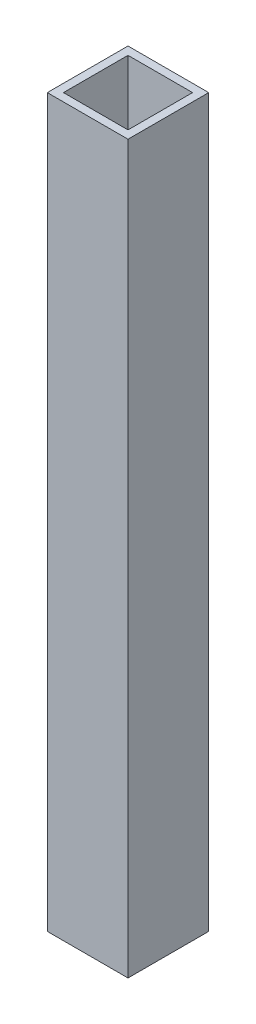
ISO-10303-21;
HEADER;
FILE_DESCRIPTION(('STEP AP214'),'2;1');
FILE_NAME('part.step','',(''),(''),'','','');
FILE_SCHEMA(('AUTOMOTIVE_DESIGN { 1 0 10303 214 1 1 1 1 }'));
ENDSEC;
DATA;
#1=APPLICATION_CONTEXT('core data for automotive mechanical design processes');
#2=APPLICATION_PROTOCOL_DEFINITION('international standard','automotive_design',2000,#1);
#3=PRODUCT_CONTEXT('',#1,'mechanical');
#4=PRODUCT('Part','Part','',(#3));
#5=PRODUCT_RELATED_PRODUCT_CATEGORY('part','',(#4));
#6=PRODUCT_DEFINITION_FORMATION('','',#4);
#7=PRODUCT_DEFINITION_CONTEXT('part definition',#1,'design');
#8=PRODUCT_DEFINITION('design','',#6,#7);
#9=PRODUCT_DEFINITION_SHAPE('','',#8);
#10=(LENGTH_UNIT() NAMED_UNIT(*) SI_UNIT(.MILLI.,.METRE.));
#11=(NAMED_UNIT(*) PLANE_ANGLE_UNIT() SI_UNIT($,.RADIAN.));
#12=(NAMED_UNIT(*) SI_UNIT($,.STERADIAN.) SOLID_ANGLE_UNIT());
#13=UNCERTAINTY_MEASURE_WITH_UNIT(LENGTH_MEASURE(1.E-05),#10,'distance_accuracy_value','');
#14=(GEOMETRIC_REPRESENTATION_CONTEXT(3) GLOBAL_UNCERTAINTY_ASSIGNED_CONTEXT((#13)) GLOBAL_UNIT_ASSIGNED_CONTEXT((#10,
#11,#12)) REPRESENTATION_CONTEXT('',''));
#15=CARTESIAN_POINT('',(0.,0.,0.));
#16=DIRECTION('',(0.,0.,1.));
#17=DIRECTION('',(1.,0.,0.));
#18=AXIS2_PLACEMENT_3D('',#15,#16,#17);
#19=CARTESIAN_POINT('',(0.,90.,0.));
#20=DIRECTION('',(0.,-1.,0.));
#21=DIRECTION('',(0.,0.,-1.));
#22=AXIS2_PLACEMENT_3D('',#19,#20,#21);
#23=PLANE('',#22);
#24=DIRECTION('',(0.,0.,1.));
#25=VECTOR('',#24,1.);
#26=CARTESIAN_POINT('',(0.,90.,0.));
#27=LINE('',#26,#25);
#28=CARTESIAN_POINT('',(0.,90.,-10.));
#29=VERTEX_POINT('',#28);
#30=CARTESIAN_POINT('',(0.,90.,0.));
#31=VERTEX_POINT('',#30);
#32=EDGE_CURVE('E134',#29,#31,#27,.T.);
#33=ORIENTED_EDGE('',*,*,#32,.T.);
#34=DIRECTION('',(1.,0.,0.));
#35=VECTOR('',#34,1.);
#36=CARTESIAN_POINT('',(0.,90.,0.));
#37=LINE('',#36,#35);
#38=CARTESIAN_POINT('',(10.,90.,0.));
#39=VERTEX_POINT('',#38);
#40=EDGE_CURVE('E137',#31,#39,#37,.T.);
#41=ORIENTED_EDGE('',*,*,#40,.T.);
#42=DIRECTION('',(0.,0.,-1.));
#43=VECTOR('',#42,1.);
#44=CARTESIAN_POINT('',(10.,90.,0.));
#45=LINE('',#44,#43);
#46=CARTESIAN_POINT('',(10.,90.,-10.));
#47=VERTEX_POINT('',#46);
#48=EDGE_CURVE('E140',#39,#47,#45,.T.);
#49=ORIENTED_EDGE('',*,*,#48,.T.);
#50=DIRECTION('',(-1.,0.,0.));
#51=VECTOR('',#50,1.);
#52=CARTESIAN_POINT('',(0.,90.,-10.));
#53=LINE('',#52,#51);
#54=EDGE_CURVE('E142',#47,#29,#53,.T.);
#55=ORIENTED_EDGE('',*,*,#54,.T.);
#56=EDGE_LOOP('',(#33,#41,#49,#55));
#57=FACE_BOUND('',#56,.T.);
#58=DIRECTION('',(0.,0.,1.));
#59=VECTOR('',#58,1.);
#60=CARTESIAN_POINT('',(1.,90.,-1.));
#61=LINE('',#60,#59);
#62=CARTESIAN_POINT('',(1.,90.,-9.));
#63=VERTEX_POINT('',#62);
#64=CARTESIAN_POINT('',(1.,90.,-1.));
#65=VERTEX_POINT('',#64);
#66=EDGE_CURVE('E98',#63,#65,#61,.T.);
#67=ORIENTED_EDGE('',*,*,#66,.F.);
#68=DIRECTION('',(-1.,0.,0.));
#69=VECTOR('',#68,1.);
#70=CARTESIAN_POINT('',(1.,90.,-9.));
#71=LINE('',#70,#69);
#72=CARTESIAN_POINT('',(9.,90.,-9.));
#73=VERTEX_POINT('',#72);
#74=EDGE_CURVE('E120',#73,#63,#71,.T.);
#75=ORIENTED_EDGE('',*,*,#74,.F.);
#76=DIRECTION('',(0.,0.,-1.));
#77=VECTOR('',#76,1.);
#78=CARTESIAN_POINT('',(9.,90.,-1.));
#79=LINE('',#78,#77);
#80=CARTESIAN_POINT('',(9.,90.,-1.));
#81=VERTEX_POINT('',#80);
#82=EDGE_CURVE('E118',#81,#73,#79,.T.);
#83=ORIENTED_EDGE('',*,*,#82,.F.);
#84=DIRECTION('',(1.,0.,0.));
#85=VECTOR('',#84,1.);
#86=CARTESIAN_POINT('',(1.,90.,-1.));
#87=LINE('',#86,#85);
#88=EDGE_CURVE('E106',#65,#81,#87,.T.);
#89=ORIENTED_EDGE('',*,*,#88,.F.);
#90=EDGE_LOOP('',(#67,#75,#83,#89));
#91=FACE_BOUND('',#90,.T.);
#92=ADVANCED_FACE('F33',(#57,#91),#23,.F.);
#93=CARTESIAN_POINT('',(0.,0.,0.));
#94=DIRECTION('',(0.,-1.,0.));
#95=DIRECTION('',(0.,0.,-1.));
#96=AXIS2_PLACEMENT_3D('',#93,#94,#95);
#97=PLANE('',#96);
#98=DIRECTION('',(0.,0.,1.));
#99=VECTOR('',#98,1.);
#100=CARTESIAN_POINT('',(0.,0.,0.));
#101=LINE('',#100,#99);
#102=CARTESIAN_POINT('',(0.,0.,-10.));
#103=VERTEX_POINT('',#102);
#104=CARTESIAN_POINT('',(0.,0.,0.));
#105=VERTEX_POINT('',#104);
#106=EDGE_CURVE('E114',#103,#105,#101,.T.);
#107=ORIENTED_EDGE('',*,*,#106,.F.);
#108=DIRECTION('',(-1.,0.,0.));
#109=VECTOR('',#108,1.);
#110=CARTESIAN_POINT('',(0.,0.,-10.));
#111=LINE('',#110,#109);
#112=CARTESIAN_POINT('',(10.,0.,-10.));
#113=VERTEX_POINT('',#112);
#114=EDGE_CURVE('E138',#113,#103,#111,.T.);
#115=ORIENTED_EDGE('',*,*,#114,.F.);
#116=DIRECTION('',(0.,0.,-1.));
#117=VECTOR('',#116,1.);
#118=CARTESIAN_POINT('',(10.,0.,0.));
#119=LINE('',#118,#117);
#120=CARTESIAN_POINT('',(10.,0.,0.));
#121=VERTEX_POINT('',#120);
#122=EDGE_CURVE('E149',#121,#113,#119,.T.);
#123=ORIENTED_EDGE('',*,*,#122,.F.);
#124=DIRECTION('',(1.,0.,0.));
#125=VECTOR('',#124,1.);
#126=CARTESIAN_POINT('',(0.,0.,0.));
#127=LINE('',#126,#125);
#128=EDGE_CURVE('E147',#105,#121,#127,.T.);
#129=ORIENTED_EDGE('',*,*,#128,.F.);
#130=EDGE_LOOP('',(#107,#115,#123,#129));
#131=FACE_BOUND('',#130,.T.);
#132=DIRECTION('',(-1.,0.,0.));
#133=VECTOR('',#132,1.);
#134=CARTESIAN_POINT('',(1.,0.,-9.));
#135=LINE('',#134,#133);
#136=CARTESIAN_POINT('',(9.,0.,-9.));
#137=VERTEX_POINT('',#136);
#138=CARTESIAN_POINT('',(1.,0.,-9.));
#139=VERTEX_POINT('',#138);
#140=EDGE_CURVE('E107',#137,#139,#135,.T.);
#141=ORIENTED_EDGE('',*,*,#140,.T.);
#142=DIRECTION('',(0.,0.,1.));
#143=VECTOR('',#142,1.);
#144=CARTESIAN_POINT('',(1.,0.,-1.));
#145=LINE('',#144,#143);
#146=CARTESIAN_POINT('',(1.,0.,-1.));
#147=VERTEX_POINT('',#146);
#148=EDGE_CURVE('E56',#139,#147,#145,.T.);
#149=ORIENTED_EDGE('',*,*,#148,.T.);
#150=DIRECTION('',(1.,0.,0.));
#151=VECTOR('',#150,1.);
#152=CARTESIAN_POINT('',(1.,0.,-1.));
#153=LINE('',#152,#151);
#154=CARTESIAN_POINT('',(9.,0.,-1.));
#155=VERTEX_POINT('',#154);
#156=EDGE_CURVE('E113',#147,#155,#153,.T.);
#157=ORIENTED_EDGE('',*,*,#156,.T.);
#158=DIRECTION('',(0.,0.,-1.));
#159=VECTOR('',#158,1.);
#160=CARTESIAN_POINT('',(9.,0.,-1.));
#161=LINE('',#160,#159);
#162=EDGE_CURVE('E126',#155,#137,#161,.T.);
#163=ORIENTED_EDGE('',*,*,#162,.T.);
#164=EDGE_LOOP('',(#141,#149,#157,#163));
#165=FACE_BOUND('',#164,.T.);
#166=ADVANCED_FACE('F167',(#131,#165),#97,.T.);
#167=CARTESIAN_POINT('',(0.,90.,0.));
#168=DIRECTION('',(1.,0.,0.));
#169=DIRECTION('',(0.,0.,-1.));
#170=AXIS2_PLACEMENT_3D('',#167,#168,#169);
#171=PLANE('',#170);
#172=ORIENTED_EDGE('',*,*,#106,.T.);
#173=DIRECTION('',(0.,-1.,0.));
#174=VECTOR('',#173,1.);
#175=CARTESIAN_POINT('',(0.,90.,0.));
#176=LINE('',#175,#174);
#177=EDGE_CURVE('E11',#31,#105,#176,.T.);
#178=ORIENTED_EDGE('',*,*,#177,.F.);
#179=ORIENTED_EDGE('',*,*,#32,.F.);
#180=DIRECTION('',(0.,-1.,0.));
#181=VECTOR('',#180,1.);
#182=CARTESIAN_POINT('',(0.,90.,-10.));
#183=LINE('',#182,#181);
#184=EDGE_CURVE('E144',#29,#103,#183,.T.);
#185=ORIENTED_EDGE('',*,*,#184,.T.);
#186=EDGE_LOOP('',(#172,#178,#179,#185));
#187=FACE_BOUND('',#186,.T.);
#188=ADVANCED_FACE('F35',(#187),#171,.F.);
#189=CARTESIAN_POINT('',(0.,90.,0.));
#190=DIRECTION('',(0.,0.,-1.));
#191=DIRECTION('',(-1.,0.,0.));
#192=AXIS2_PLACEMENT_3D('',#189,#190,#191);
#193=PLANE('',#192);
#194=ORIENTED_EDGE('',*,*,#128,.T.);
#195=DIRECTION('',(0.,-1.,0.));
#196=VECTOR('',#195,1.);
#197=CARTESIAN_POINT('',(10.,90.,0.));
#198=LINE('',#197,#196);
#199=EDGE_CURVE('E41',#39,#121,#198,.T.);
#200=ORIENTED_EDGE('',*,*,#199,.F.);
#201=ORIENTED_EDGE('',*,*,#40,.F.);
#202=ORIENTED_EDGE('',*,*,#177,.T.);
#203=EDGE_LOOP('',(#194,#200,#201,#202));
#204=FACE_BOUND('',#203,.T.);
#205=ADVANCED_FACE('F177',(#204),#193,.F.);
#206=CARTESIAN_POINT('',(10.,90.,0.));
#207=DIRECTION('',(-1.,0.,0.));
#208=DIRECTION('',(0.,0.,1.));
#209=AXIS2_PLACEMENT_3D('',#206,#207,#208);
#210=PLANE('',#209);
#211=ORIENTED_EDGE('',*,*,#122,.T.);
#212=DIRECTION('',(0.,-1.,0.));
#213=VECTOR('',#212,1.);
#214=CARTESIAN_POINT('',(10.,90.,-10.));
#215=LINE('',#214,#213);
#216=EDGE_CURVE('E154',#47,#113,#215,.T.);
#217=ORIENTED_EDGE('',*,*,#216,.F.);
#218=ORIENTED_EDGE('',*,*,#48,.F.);
#219=ORIENTED_EDGE('',*,*,#199,.T.);
#220=EDGE_LOOP('',(#211,#217,#218,#219));
#221=FACE_BOUND('',#220,.T.);
#222=ADVANCED_FACE('F161',(#221),#210,.F.);
#223=CARTESIAN_POINT('',(0.,90.,-10.));
#224=DIRECTION('',(0.,0.,1.));
#225=DIRECTION('',(1.,0.,0.));
#226=AXIS2_PLACEMENT_3D('',#223,#224,#225);
#227=PLANE('',#226);
#228=ORIENTED_EDGE('',*,*,#114,.T.);
#229=ORIENTED_EDGE('',*,*,#184,.F.);
#230=ORIENTED_EDGE('',*,*,#54,.F.);
#231=ORIENTED_EDGE('',*,*,#216,.T.);
#232=EDGE_LOOP('',(#228,#229,#230,#231));
#233=FACE_BOUND('',#232,.T.);
#234=ADVANCED_FACE('F171',(#233),#227,.F.);
#235=CARTESIAN_POINT('',(1.,90.,-1.));
#236=DIRECTION('',(1.,0.,0.));
#237=DIRECTION('',(0.,0.,-1.));
#238=AXIS2_PLACEMENT_3D('',#235,#236,#237);
#239=PLANE('',#238);
#240=ORIENTED_EDGE('',*,*,#148,.F.);
#241=DIRECTION('',(0.,-1.,0.));
#242=VECTOR('',#241,1.);
#243=CARTESIAN_POINT('',(1.,90.,-9.));
#244=LINE('',#243,#242);
#245=EDGE_CURVE('E102',#63,#139,#244,.T.);
#246=ORIENTED_EDGE('',*,*,#245,.F.);
#247=ORIENTED_EDGE('',*,*,#66,.T.);
#248=DIRECTION('',(0.,-1.,0.));
#249=VECTOR('',#248,1.);
#250=CARTESIAN_POINT('',(1.,90.,-1.));
#251=LINE('',#250,#249);
#252=EDGE_CURVE('E101',#65,#147,#251,.T.);
#253=ORIENTED_EDGE('',*,*,#252,.T.);
#254=EDGE_LOOP('',(#240,#246,#247,#253));
#255=FACE_BOUND('',#254,.T.);
#256=ADVANCED_FACE('F100',(#255),#239,.T.);
#257=CARTESIAN_POINT('',(1.,90.,-1.));
#258=DIRECTION('',(0.,0.,-1.));
#259=DIRECTION('',(-1.,0.,0.));
#260=AXIS2_PLACEMENT_3D('',#257,#258,#259);
#261=PLANE('',#260);
#262=ORIENTED_EDGE('',*,*,#156,.F.);
#263=ORIENTED_EDGE('',*,*,#252,.F.);
#264=ORIENTED_EDGE('',*,*,#88,.T.);
#265=DIRECTION('',(0.,-1.,0.));
#266=VECTOR('',#265,1.);
#267=CARTESIAN_POINT('',(9.,90.,-1.));
#268=LINE('',#267,#266);
#269=EDGE_CURVE('E115',#81,#155,#268,.T.);
#270=ORIENTED_EDGE('',*,*,#269,.T.);
#271=EDGE_LOOP('',(#262,#263,#264,#270));
#272=FACE_BOUND('',#271,.T.);
#273=ADVANCED_FACE('F110',(#272),#261,.T.);
#274=CARTESIAN_POINT('',(9.,90.,-1.));
#275=DIRECTION('',(-1.,0.,0.));
#276=DIRECTION('',(0.,0.,1.));
#277=AXIS2_PLACEMENT_3D('',#274,#275,#276);
#278=PLANE('',#277);
#279=ORIENTED_EDGE('',*,*,#162,.F.);
#280=ORIENTED_EDGE('',*,*,#269,.F.);
#281=ORIENTED_EDGE('',*,*,#82,.T.);
#282=DIRECTION('',(0.,-1.,0.));
#283=VECTOR('',#282,1.);
#284=CARTESIAN_POINT('',(9.,90.,-9.));
#285=LINE('',#284,#283);
#286=EDGE_CURVE('E48',#73,#137,#285,.T.);
#287=ORIENTED_EDGE('',*,*,#286,.T.);
#288=EDGE_LOOP('',(#279,#280,#281,#287));
#289=FACE_BOUND('',#288,.T.);
#290=ADVANCED_FACE('F200',(#289),#278,.T.);
#291=CARTESIAN_POINT('',(1.,90.,-9.));
#292=DIRECTION('',(0.,0.,1.));
#293=DIRECTION('',(1.,0.,0.));
#294=AXIS2_PLACEMENT_3D('',#291,#292,#293);
#295=PLANE('',#294);
#296=ORIENTED_EDGE('',*,*,#140,.F.);
#297=ORIENTED_EDGE('',*,*,#286,.F.);
#298=ORIENTED_EDGE('',*,*,#74,.T.);
#299=ORIENTED_EDGE('',*,*,#245,.T.);
#300=EDGE_LOOP('',(#296,#297,#298,#299));
#301=FACE_BOUND('',#300,.T.);
#302=ADVANCED_FACE('F204',(#301),#295,.T.);
#303=CLOSED_SHELL('',(#92,#166,#188,#205,#222,#234,#256,#273,#290,#302));
#304=MANIFOLD_SOLID_BREP('B2',#303);
#305=ADVANCED_BREP_SHAPE_REPRESENTATION('',(#18,#304),#14);
#306=SHAPE_DEFINITION_REPRESENTATION(#9,#305);
ENDSEC;
END-ISO-10303-21;
